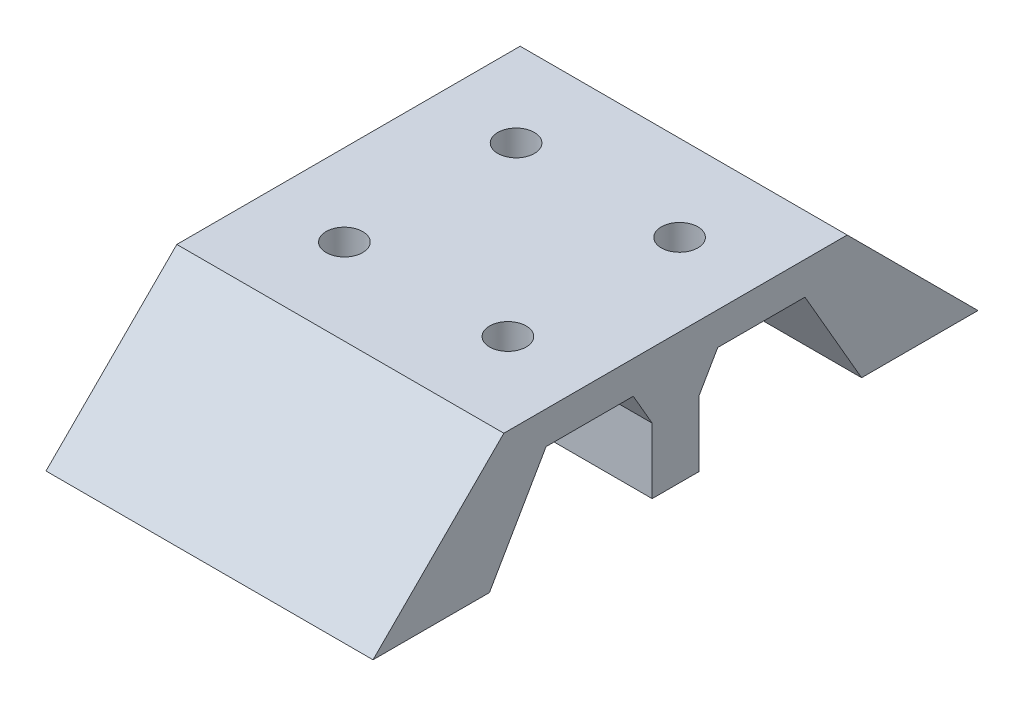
ISO-10303-21;
HEADER;
FILE_DESCRIPTION(('STEP AP214'),'2;1');
FILE_NAME('part.step','',(''),(''),'','','');
FILE_SCHEMA(('AUTOMOTIVE_DESIGN { 1 0 10303 214 1 1 1 1 }'));
ENDSEC;
DATA;
#1=APPLICATION_CONTEXT('core data for automotive mechanical design processes');
#2=APPLICATION_PROTOCOL_DEFINITION('international standard','automotive_design',2000,#1);
#3=PRODUCT_CONTEXT('',#1,'mechanical');
#4=PRODUCT('Part','Part','',(#3));
#5=PRODUCT_RELATED_PRODUCT_CATEGORY('part','',(#4));
#6=PRODUCT_DEFINITION_FORMATION('','',#4);
#7=PRODUCT_DEFINITION_CONTEXT('part definition',#1,'design');
#8=PRODUCT_DEFINITION('design','',#6,#7);
#9=PRODUCT_DEFINITION_SHAPE('','',#8);
#10=(LENGTH_UNIT() NAMED_UNIT(*) SI_UNIT(.MILLI.,.METRE.));
#11=(NAMED_UNIT(*) PLANE_ANGLE_UNIT() SI_UNIT($,.RADIAN.));
#12=(NAMED_UNIT(*) SI_UNIT($,.STERADIAN.) SOLID_ANGLE_UNIT());
#13=UNCERTAINTY_MEASURE_WITH_UNIT(LENGTH_MEASURE(1.E-05),#10,'distance_accuracy_value','');
#14=(GEOMETRIC_REPRESENTATION_CONTEXT(3) GLOBAL_UNCERTAINTY_ASSIGNED_CONTEXT((#13)) GLOBAL_UNIT_ASSIGNED_CONTEXT((#10,
#11,#12)) REPRESENTATION_CONTEXT('',''));
#15=CARTESIAN_POINT('',(0.,0.,0.));
#16=DIRECTION('',(0.,0.,1.));
#17=DIRECTION('',(1.,0.,0.));
#18=AXIS2_PLACEMENT_3D('',#15,#16,#17);
#19=CARTESIAN_POINT('',(38.1,10.9525,10.9524999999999));
#20=DIRECTION('',(0.,-0.707106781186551,-0.707106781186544));
#21=DIRECTION('',(0.,0.707106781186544,-0.707106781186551));
#22=AXIS2_PLACEMENT_3D('',#19,#20,#21);
#23=PLANE('',#22);
#24=DIRECTION('',(0.,-0.707106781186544,0.707106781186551));
#25=VECTOR('',#24,1.);
#26=CARTESIAN_POINT('',(0.,10.9525,10.9524999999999));
#27=LINE('',#26,#25);
#28=CARTESIAN_POINT('',(0.,1.905,20.));
#29=VERTEX_POINT('',#28);
#30=CARTESIAN_POINT('',(0.,-13.335,35.2400000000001));
#31=VERTEX_POINT('',#30);
#32=EDGE_CURVE('E184',#29,#31,#27,.T.);
#33=ORIENTED_EDGE('',*,*,#32,.T.);
#34=DIRECTION('',(-1.,0.,0.));
#35=VECTOR('',#34,1.);
#36=CARTESIAN_POINT('',(38.1,-13.335,35.2400000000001));
#37=LINE('',#36,#35);
#38=CARTESIAN_POINT('',(38.1,-13.335,35.2400000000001));
#39=VERTEX_POINT('',#38);
#40=EDGE_CURVE('E270',#39,#31,#37,.T.);
#41=ORIENTED_EDGE('',*,*,#40,.F.);
#42=DIRECTION('',(0.,-0.707106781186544,0.707106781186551));
#43=VECTOR('',#42,1.);
#44=CARTESIAN_POINT('',(38.1,10.9525,10.9524999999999));
#45=LINE('',#44,#43);
#46=CARTESIAN_POINT('',(38.1,1.905,20.));
#47=VERTEX_POINT('',#46);
#48=EDGE_CURVE('E236',#47,#39,#45,.T.);
#49=ORIENTED_EDGE('',*,*,#48,.F.);
#50=DIRECTION('',(-1.,0.,0.));
#51=VECTOR('',#50,1.);
#52=CARTESIAN_POINT('',(38.1,1.905,20.));
#53=LINE('',#52,#51);
#54=EDGE_CURVE('E180',#47,#29,#53,.T.);
#55=ORIENTED_EDGE('',*,*,#54,.T.);
#56=EDGE_LOOP('',(#33,#41,#49,#55));
#57=FACE_BOUND('',#56,.T.);
#58=ADVANCED_FACE('F45',(#57),#23,.F.);
#59=CARTESIAN_POINT('',(38.1,-13.335,0.));
#60=DIRECTION('',(0.,1.,0.));
#61=DIRECTION('',(0.,0.,1.));
#62=AXIS2_PLACEMENT_3D('',#59,#60,#61);
#63=PLANE('',#62);
#64=DIRECTION('',(0.,0.,-1.));
#65=VECTOR('',#64,1.);
#66=CARTESIAN_POINT('',(0.,-13.335,0.));
#67=LINE('',#66,#65);
#68=CARTESIAN_POINT('',(0.,-13.335,21.6791135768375));
#69=VERTEX_POINT('',#68);
#70=EDGE_CURVE('E188',#31,#69,#67,.T.);
#71=ORIENTED_EDGE('',*,*,#70,.T.);
#72=DIRECTION('',(-1.,0.,0.));
#73=VECTOR('',#72,1.);
#74=CARTESIAN_POINT('',(38.1,-13.335,21.6791135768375));
#75=LINE('',#74,#73);
#76=CARTESIAN_POINT('',(38.1,-13.335,21.6791135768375));
#77=VERTEX_POINT('',#76);
#78=EDGE_CURVE('E267',#77,#69,#75,.T.);
#79=ORIENTED_EDGE('',*,*,#78,.F.);
#80=DIRECTION('',(0.,0.,-1.));
#81=VECTOR('',#80,1.);
#82=CARTESIAN_POINT('',(38.1,-13.335,0.));
#83=LINE('',#82,#81);
#84=EDGE_CURVE('E122',#39,#77,#83,.T.);
#85=ORIENTED_EDGE('',*,*,#84,.F.);
#86=ORIENTED_EDGE('',*,*,#40,.T.);
#87=EDGE_LOOP('',(#71,#79,#85,#86));
#88=FACE_BOUND('',#87,.T.);
#89=ADVANCED_FACE('F400',(#88),#63,.F.);
#90=CARTESIAN_POINT('',(38.1,6.05358154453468,10.4851108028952));
#91=DIRECTION('',(0.,-0.500000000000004,-0.866025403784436));
#92=DIRECTION('',(0.,0.866025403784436,-0.500000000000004));
#93=AXIS2_PLACEMENT_3D('',#90,#91,#92);
#94=PLANE('',#93);
#95=DIRECTION('',(0.,-0.866025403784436,0.500000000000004));
#96=VECTOR('',#95,1.);
#97=CARTESIAN_POINT('',(0.,6.05358154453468,10.4851108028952));
#98=LINE('',#97,#96);
#99=CARTESIAN_POINT('',(0.,-1.905,15.08));
#100=VERTEX_POINT('',#99);
#101=EDGE_CURVE('E193',#100,#69,#98,.T.);
#102=ORIENTED_EDGE('',*,*,#101,.F.);
#103=DIRECTION('',(-1.,0.,0.));
#104=VECTOR('',#103,1.);
#105=CARTESIAN_POINT('',(38.1,-1.905,15.08));
#106=LINE('',#105,#104);
#107=CARTESIAN_POINT('',(38.1,-1.905,15.08));
#108=VERTEX_POINT('',#107);
#109=EDGE_CURVE('E264',#108,#100,#106,.T.);
#110=ORIENTED_EDGE('',*,*,#109,.F.);
#111=DIRECTION('',(0.,-0.866025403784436,0.500000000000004));
#112=VECTOR('',#111,1.);
#113=CARTESIAN_POINT('',(38.1,6.05358154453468,10.4851108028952));
#114=LINE('',#113,#112);
#115=EDGE_CURVE('E346',#108,#77,#114,.T.);
#116=ORIENTED_EDGE('',*,*,#115,.T.);
#117=ORIENTED_EDGE('',*,*,#78,.T.);
#118=EDGE_LOOP('',(#102,#110,#116,#117));
#119=FACE_BOUND('',#118,.T.);
#120=ADVANCED_FACE('F405',(#119),#94,.T.);
#121=CARTESIAN_POINT('',(38.1,-1.905,0.));
#122=DIRECTION('',(0.,1.,0.));
#123=DIRECTION('',(0.,0.,1.));
#124=AXIS2_PLACEMENT_3D('',#121,#122,#123);
#125=PLANE('',#124);
#126=CARTESIAN_POINT('',(9.525,-1.905,9.99999999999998));
#127=DIRECTION('',(0.,1.,0.));
#128=DIRECTION('',(0.,0.,1.));
#129=AXIS2_PLACEMENT_3D('',#126,#127,#128);
#130=CIRCLE('',#129,3.18770000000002);
#131=CARTESIAN_POINT('',(9.525,-1.905,13.1877));
#132=VERTEX_POINT('',#131);
#133=EDGE_CURVE('E300',#132,#132,#130,.T.);
#134=ORIENTED_EDGE('',*,*,#133,.T.);
#135=EDGE_LOOP('',(#134));
#136=FACE_BOUND('',#135,.T.);
#137=CARTESIAN_POINT('',(28.575,-1.905,9.99999999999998));
#138=DIRECTION('',(0.,1.,0.));
#139=DIRECTION('',(0.,0.,1.));
#140=AXIS2_PLACEMENT_3D('',#137,#138,#139);
#141=CIRCLE('',#140,3.18770000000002);
#142=CARTESIAN_POINT('',(28.575,-1.905,13.1877));
#143=VERTEX_POINT('',#142);
#144=EDGE_CURVE('E296',#143,#143,#141,.T.);
#145=ORIENTED_EDGE('',*,*,#144,.T.);
#146=EDGE_LOOP('',(#145));
#147=FACE_BOUND('',#146,.T.);
#148=DIRECTION('',(0.,0.,-1.));
#149=VECTOR('',#148,1.);
#150=CARTESIAN_POINT('',(0.,-1.905,0.));
#151=LINE('',#150,#149);
#152=CARTESIAN_POINT('',(0.,-1.905,4.91999999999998));
#153=VERTEX_POINT('',#152);
#154=EDGE_CURVE('E197',#100,#153,#151,.T.);
#155=ORIENTED_EDGE('',*,*,#154,.T.);
#156=DIRECTION('',(-1.,0.,0.));
#157=VECTOR('',#156,1.);
#158=CARTESIAN_POINT('',(38.1,-1.905,4.91999999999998));
#159=LINE('',#158,#157);
#160=CARTESIAN_POINT('',(38.1,-1.905,4.91999999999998));
#161=VERTEX_POINT('',#160);
#162=EDGE_CURVE('E261',#161,#153,#159,.T.);
#163=ORIENTED_EDGE('',*,*,#162,.F.);
#164=DIRECTION('',(0.,0.,-1.));
#165=VECTOR('',#164,1.);
#166=CARTESIAN_POINT('',(38.1,-1.905,0.));
#167=LINE('',#166,#165);
#168=EDGE_CURVE('E350',#108,#161,#167,.T.);
#169=ORIENTED_EDGE('',*,*,#168,.F.);
#170=ORIENTED_EDGE('',*,*,#109,.T.);
#171=EDGE_LOOP('',(#155,#163,#169,#170));
#172=FACE_BOUND('',#171,.T.);
#173=ADVANCED_FACE('F510',(#136,#147,#172),#125,.F.);
#174=CARTESIAN_POINT('',(38.1,-2.60667249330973,4.51488919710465));
#175=DIRECTION('',(0.,-0.500000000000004,0.866025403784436));
#176=DIRECTION('',(0.,-0.866025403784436,-0.500000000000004));
#177=AXIS2_PLACEMENT_3D('',#174,#175,#176);
#178=PLANE('',#177);
#179=DIRECTION('',(0.,0.866025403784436,0.500000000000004));
#180=VECTOR('',#179,1.);
#181=CARTESIAN_POINT('',(0.,-2.60667249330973,4.51488919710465));
#182=LINE('',#181,#180);
#183=CARTESIAN_POINT('',(0.,-5.715,2.72029547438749));
#184=VERTEX_POINT('',#183);
#185=EDGE_CURVE('E201',#184,#153,#182,.T.);
#186=ORIENTED_EDGE('',*,*,#185,.F.);
#187=DIRECTION('',(-1.,0.,0.));
#188=VECTOR('',#187,1.);
#189=CARTESIAN_POINT('',(38.1,-5.715,2.72029547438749));
#190=LINE('',#189,#188);
#191=CARTESIAN_POINT('',(38.1,-5.715,2.72029547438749));
#192=VERTEX_POINT('',#191);
#193=EDGE_CURVE('E258',#192,#184,#190,.T.);
#194=ORIENTED_EDGE('',*,*,#193,.F.);
#195=DIRECTION('',(0.,0.866025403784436,0.500000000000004));
#196=VECTOR('',#195,1.);
#197=CARTESIAN_POINT('',(38.1,-2.60667249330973,4.51488919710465));
#198=LINE('',#197,#196);
#199=EDGE_CURVE('E353',#192,#161,#198,.T.);
#200=ORIENTED_EDGE('',*,*,#199,.T.);
#201=ORIENTED_EDGE('',*,*,#162,.T.);
#202=EDGE_LOOP('',(#186,#194,#200,#201));
#203=FACE_BOUND('',#202,.T.);
#204=ADVANCED_FACE('F514',(#203),#178,.T.);
#205=CARTESIAN_POINT('',(38.1,0.,2.72029547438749));
#206=DIRECTION('',(0.,0.,1.));
#207=DIRECTION('',(1.,0.,0.));
#208=AXIS2_PLACEMENT_3D('',#205,#206,#207);
#209=PLANE('',#208);
#210=DIRECTION('',(0.,1.,0.));
#211=VECTOR('',#210,1.);
#212=CARTESIAN_POINT('',(0.,0.,2.72029547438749));
#213=LINE('',#212,#211);
#214=CARTESIAN_POINT('',(0.,-13.335,2.72029547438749));
#215=VERTEX_POINT('',#214);
#216=EDGE_CURVE('E205',#215,#184,#213,.T.);
#217=ORIENTED_EDGE('',*,*,#216,.F.);
#218=DIRECTION('',(-1.,0.,0.));
#219=VECTOR('',#218,1.);
#220=CARTESIAN_POINT('',(38.1,-13.335,2.72029547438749));
#221=LINE('',#220,#219);
#222=CARTESIAN_POINT('',(38.1,-13.335,2.72029547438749));
#223=VERTEX_POINT('',#222);
#224=EDGE_CURVE('E255',#223,#215,#221,.T.);
#225=ORIENTED_EDGE('',*,*,#224,.F.);
#226=DIRECTION('',(0.,1.,0.));
#227=VECTOR('',#226,1.);
#228=CARTESIAN_POINT('',(38.1,0.,2.72029547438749));
#229=LINE('',#228,#227);
#230=EDGE_CURVE('E357',#223,#192,#229,.T.);
#231=ORIENTED_EDGE('',*,*,#230,.T.);
#232=ORIENTED_EDGE('',*,*,#193,.T.);
#233=EDGE_LOOP('',(#217,#225,#231,#232));
#234=FACE_BOUND('',#233,.T.);
#235=ADVANCED_FACE('F599',(#234),#209,.T.);
#236=CARTESIAN_POINT('',(38.1,-13.335,0.));
#237=DIRECTION('',(0.,-1.,0.));
#238=DIRECTION('',(0.,0.,-1.));
#239=AXIS2_PLACEMENT_3D('',#236,#237,#238);
#240=PLANE('',#239);
#241=DIRECTION('',(0.,0.,1.));
#242=VECTOR('',#241,1.);
#243=CARTESIAN_POINT('',(0.,-13.335,0.));
#244=LINE('',#243,#242);
#245=CARTESIAN_POINT('',(0.,-13.335,-2.72029547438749));
#246=VERTEX_POINT('',#245);
#247=EDGE_CURVE('E209',#246,#215,#244,.T.);
#248=ORIENTED_EDGE('',*,*,#247,.F.);
#249=DIRECTION('',(-1.,0.,0.));
#250=VECTOR('',#249,1.);
#251=CARTESIAN_POINT('',(38.1,-13.335,-2.72029547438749));
#252=LINE('',#251,#250);
#253=CARTESIAN_POINT('',(38.1,-13.335,-2.72029547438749));
#254=VERTEX_POINT('',#253);
#255=EDGE_CURVE('E252',#254,#246,#252,.T.);
#256=ORIENTED_EDGE('',*,*,#255,.F.);
#257=DIRECTION('',(0.,0.,1.));
#258=VECTOR('',#257,1.);
#259=CARTESIAN_POINT('',(38.1,-13.335,0.));
#260=LINE('',#259,#258);
#261=EDGE_CURVE('E361',#254,#223,#260,.T.);
#262=ORIENTED_EDGE('',*,*,#261,.T.);
#263=ORIENTED_EDGE('',*,*,#224,.T.);
#264=EDGE_LOOP('',(#248,#256,#262,#263));
#265=FACE_BOUND('',#264,.T.);
#266=ADVANCED_FACE('F595',(#265),#240,.T.);
#267=CARTESIAN_POINT('',(38.1,0.,-2.72029547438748));
#268=DIRECTION('',(0.,0.,-1.));
#269=DIRECTION('',(0.,1.,0.));
#270=AXIS2_PLACEMENT_3D('',#267,#268,#269);
#271=PLANE('',#270);
#272=DIRECTION('',(0.,-1.,0.));
#273=VECTOR('',#272,1.);
#274=CARTESIAN_POINT('',(0.,0.,-2.72029547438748));
#275=LINE('',#274,#273);
#276=CARTESIAN_POINT('',(0.,-5.715,-2.72029547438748));
#277=VERTEX_POINT('',#276);
#278=EDGE_CURVE('E213',#277,#246,#275,.T.);
#279=ORIENTED_EDGE('',*,*,#278,.F.);
#280=DIRECTION('',(-1.,0.,0.));
#281=VECTOR('',#280,1.);
#282=CARTESIAN_POINT('',(38.1,-5.715,-2.72029547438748));
#283=LINE('',#282,#281);
#284=CARTESIAN_POINT('',(38.1,-5.715,-2.72029547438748));
#285=VERTEX_POINT('',#284);
#286=EDGE_CURVE('E249',#285,#277,#283,.T.);
#287=ORIENTED_EDGE('',*,*,#286,.F.);
#288=DIRECTION('',(0.,-1.,0.));
#289=VECTOR('',#288,1.);
#290=CARTESIAN_POINT('',(38.1,0.,-2.72029547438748));
#291=LINE('',#290,#289);
#292=EDGE_CURVE('E365',#285,#254,#291,.T.);
#293=ORIENTED_EDGE('',*,*,#292,.T.);
#294=ORIENTED_EDGE('',*,*,#255,.T.);
#295=EDGE_LOOP('',(#279,#287,#293,#294));
#296=FACE_BOUND('',#295,.T.);
#297=ADVANCED_FACE('F592',(#296),#271,.T.);
#298=CARTESIAN_POINT('',(38.1,-2.60667249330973,-4.51488919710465));
#299=DIRECTION('',(0.,-0.500000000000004,-0.866025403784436));
#300=DIRECTION('',(0.,0.866025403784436,-0.500000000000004));
#301=AXIS2_PLACEMENT_3D('',#298,#299,#300);
#302=PLANE('',#301);
#303=DIRECTION('',(0.,-0.866025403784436,0.500000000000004));
#304=VECTOR('',#303,1.);
#305=CARTESIAN_POINT('',(0.,-2.60667249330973,-4.51488919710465));
#306=LINE('',#305,#304);
#307=CARTESIAN_POINT('',(0.,-1.905,-4.91999999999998));
#308=VERTEX_POINT('',#307);
#309=EDGE_CURVE('E217',#308,#277,#306,.T.);
#310=ORIENTED_EDGE('',*,*,#309,.F.);
#311=DIRECTION('',(-1.,0.,0.));
#312=VECTOR('',#311,1.);
#313=CARTESIAN_POINT('',(38.1,-1.905,-4.91999999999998));
#314=LINE('',#313,#312);
#315=CARTESIAN_POINT('',(38.1,-1.905,-4.91999999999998));
#316=VERTEX_POINT('',#315);
#317=EDGE_CURVE('E246',#316,#308,#314,.T.);
#318=ORIENTED_EDGE('',*,*,#317,.F.);
#319=DIRECTION('',(0.,-0.866025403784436,0.500000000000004));
#320=VECTOR('',#319,1.);
#321=CARTESIAN_POINT('',(38.1,-2.60667249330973,-4.51488919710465));
#322=LINE('',#321,#320);
#323=EDGE_CURVE('E369',#316,#285,#322,.T.);
#324=ORIENTED_EDGE('',*,*,#323,.T.);
#325=ORIENTED_EDGE('',*,*,#286,.T.);
#326=EDGE_LOOP('',(#310,#318,#324,#325));
#327=FACE_BOUND('',#326,.T.);
#328=ADVANCED_FACE('F527',(#327),#302,.T.);
#329=CARTESIAN_POINT('',(38.1,-1.905,0.));
#330=DIRECTION('',(0.,-1.,0.));
#331=DIRECTION('',(0.,0.,-1.));
#332=AXIS2_PLACEMENT_3D('',#329,#330,#331);
#333=PLANE('',#332);
#334=CARTESIAN_POINT('',(28.575,-1.905,-9.99999999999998));
#335=DIRECTION('',(0.,-1.,0.));
#336=DIRECTION('',(0.,0.,-1.));
#337=AXIS2_PLACEMENT_3D('',#334,#335,#336);
#338=CIRCLE('',#337,3.18770000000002);
#339=CARTESIAN_POINT('',(28.575,-1.905,-13.1877));
#340=VERTEX_POINT('',#339);
#341=EDGE_CURVE('E56',#340,#340,#338,.F.);
#342=ORIENTED_EDGE('',*,*,#341,.T.);
#343=EDGE_LOOP('',(#342));
#344=FACE_BOUND('',#343,.T.);
#345=CARTESIAN_POINT('',(9.525,-1.905,-9.99999999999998));
#346=DIRECTION('',(0.,-1.,0.));
#347=DIRECTION('',(0.,0.,-1.));
#348=AXIS2_PLACEMENT_3D('',#345,#346,#347);
#349=CIRCLE('',#348,3.18770000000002);
#350=CARTESIAN_POINT('',(9.525,-1.905,-13.1877));
#351=VERTEX_POINT('',#350);
#352=EDGE_CURVE('E312',#351,#351,#349,.F.);
#353=ORIENTED_EDGE('',*,*,#352,.T.);
#354=EDGE_LOOP('',(#353));
#355=FACE_BOUND('',#354,.T.);
#356=DIRECTION('',(0.,0.,1.));
#357=VECTOR('',#356,1.);
#358=CARTESIAN_POINT('',(0.,-1.905,0.));
#359=LINE('',#358,#357);
#360=CARTESIAN_POINT('',(0.,-1.905,-15.08));
#361=VERTEX_POINT('',#360);
#362=EDGE_CURVE('E221',#361,#308,#359,.T.);
#363=ORIENTED_EDGE('',*,*,#362,.F.);
#364=DIRECTION('',(-1.,0.,0.));
#365=VECTOR('',#364,1.);
#366=CARTESIAN_POINT('',(38.1,-1.905,-15.08));
#367=LINE('',#366,#365);
#368=CARTESIAN_POINT('',(38.1,-1.905,-15.08));
#369=VERTEX_POINT('',#368);
#370=EDGE_CURVE('E243',#369,#361,#367,.T.);
#371=ORIENTED_EDGE('',*,*,#370,.F.);
#372=DIRECTION('',(0.,0.,1.));
#373=VECTOR('',#372,1.);
#374=CARTESIAN_POINT('',(38.1,-1.905,0.));
#375=LINE('',#374,#373);
#376=EDGE_CURVE('E373',#369,#316,#375,.T.);
#377=ORIENTED_EDGE('',*,*,#376,.T.);
#378=ORIENTED_EDGE('',*,*,#317,.T.);
#379=EDGE_LOOP('',(#363,#371,#377,#378));
#380=FACE_BOUND('',#379,.T.);
#381=ADVANCED_FACE('F319',(#344,#355,#380),#333,.T.);
#382=CARTESIAN_POINT('',(38.1,6.05358154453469,-10.4851108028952));
#383=DIRECTION('',(0.,-0.500000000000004,0.866025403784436));
#384=DIRECTION('',(0.,-0.866025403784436,-0.500000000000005));
#385=AXIS2_PLACEMENT_3D('',#382,#383,#384);
#386=PLANE('',#385);
#387=DIRECTION('',(0.,0.866025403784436,0.500000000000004));
#388=VECTOR('',#387,1.);
#389=CARTESIAN_POINT('',(0.,6.05358154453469,-10.4851108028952));
#390=LINE('',#389,#388);
#391=CARTESIAN_POINT('',(0.,-13.335,-21.6791135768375));
#392=VERTEX_POINT('',#391);
#393=EDGE_CURVE('E225',#392,#361,#390,.T.);
#394=ORIENTED_EDGE('',*,*,#393,.F.);
#395=DIRECTION('',(-1.,0.,0.));
#396=VECTOR('',#395,1.);
#397=CARTESIAN_POINT('',(38.1,-13.335,-21.6791135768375));
#398=LINE('',#397,#396);
#399=CARTESIAN_POINT('',(38.1,-13.335,-21.6791135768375));
#400=VERTEX_POINT('',#399);
#401=EDGE_CURVE('E174',#400,#392,#398,.T.);
#402=ORIENTED_EDGE('',*,*,#401,.F.);
#403=DIRECTION('',(0.,0.866025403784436,0.500000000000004));
#404=VECTOR('',#403,1.);
#405=CARTESIAN_POINT('',(38.1,6.05358154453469,-10.4851108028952));
#406=LINE('',#405,#404);
#407=EDGE_CURVE('E161',#400,#369,#406,.T.);
#408=ORIENTED_EDGE('',*,*,#407,.T.);
#409=ORIENTED_EDGE('',*,*,#370,.T.);
#410=EDGE_LOOP('',(#394,#402,#408,#409));
#411=FACE_BOUND('',#410,.T.);
#412=ADVANCED_FACE('F379',(#411),#386,.T.);
#413=CARTESIAN_POINT('',(38.1,-13.335,0.));
#414=DIRECTION('',(0.,1.,0.));
#415=DIRECTION('',(0.,0.,1.));
#416=AXIS2_PLACEMENT_3D('',#413,#414,#415);
#417=PLANE('',#416);
#418=DIRECTION('',(0.,0.,-1.));
#419=VECTOR('',#418,1.);
#420=CARTESIAN_POINT('',(0.,-13.335,0.));
#421=LINE('',#420,#419);
#422=CARTESIAN_POINT('',(0.,-13.335,-35.2399999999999));
#423=VERTEX_POINT('',#422);
#424=EDGE_CURVE('E169',#392,#423,#421,.T.);
#425=ORIENTED_EDGE('',*,*,#424,.T.);
#426=DIRECTION('',(-1.,0.,0.));
#427=VECTOR('',#426,1.);
#428=CARTESIAN_POINT('',(38.1,-13.335,-35.2399999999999));
#429=LINE('',#428,#427);
#430=CARTESIAN_POINT('',(38.1,-13.335,-35.2399999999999));
#431=VERTEX_POINT('',#430);
#432=EDGE_CURVE('E166',#431,#423,#429,.T.);
#433=ORIENTED_EDGE('',*,*,#432,.F.);
#434=DIRECTION('',(0.,0.,-1.));
#435=VECTOR('',#434,1.);
#436=CARTESIAN_POINT('',(38.1,-13.335,0.));
#437=LINE('',#436,#435);
#438=EDGE_CURVE('E154',#400,#431,#437,.T.);
#439=ORIENTED_EDGE('',*,*,#438,.F.);
#440=ORIENTED_EDGE('',*,*,#401,.T.);
#441=EDGE_LOOP('',(#425,#433,#439,#440));
#442=FACE_BOUND('',#441,.T.);
#443=ADVANCED_FACE('F167',(#442),#417,.F.);
#444=CARTESIAN_POINT('',(38.1,10.9525,-10.9525000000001));
#445=DIRECTION('',(0.,0.707106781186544,-0.707106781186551));
#446=DIRECTION('',(0.,0.707106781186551,0.707106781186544));
#447=AXIS2_PLACEMENT_3D('',#444,#445,#446);
#448=PLANE('',#447);
#449=DIRECTION('',(0.,-0.707106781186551,-0.707106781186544));
#450=VECTOR('',#449,1.);
#451=CARTESIAN_POINT('',(0.,10.9525,-10.9525000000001));
#452=LINE('',#451,#450);
#453=CARTESIAN_POINT('',(0.,1.905,-20.));
#454=VERTEX_POINT('',#453);
#455=EDGE_CURVE('E231',#454,#423,#452,.T.);
#456=ORIENTED_EDGE('',*,*,#455,.F.);
#457=DIRECTION('',(-1.,0.,0.));
#458=VECTOR('',#457,1.);
#459=CARTESIAN_POINT('',(38.1,1.905,-20.));
#460=LINE('',#459,#458);
#461=CARTESIAN_POINT('',(38.1,1.905,-20.));
#462=VERTEX_POINT('',#461);
#463=EDGE_CURVE('E110',#462,#454,#460,.T.);
#464=ORIENTED_EDGE('',*,*,#463,.F.);
#465=DIRECTION('',(0.,-0.707106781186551,-0.707106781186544));
#466=VECTOR('',#465,1.);
#467=CARTESIAN_POINT('',(38.1,10.9525,-10.9525000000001));
#468=LINE('',#467,#466);
#469=EDGE_CURVE('E158',#462,#431,#468,.T.);
#470=ORIENTED_EDGE('',*,*,#469,.T.);
#471=ORIENTED_EDGE('',*,*,#432,.T.);
#472=EDGE_LOOP('',(#456,#464,#470,#471));
#473=FACE_BOUND('',#472,.T.);
#474=ADVANCED_FACE('F176',(#473),#448,.T.);
#475=CARTESIAN_POINT('',(38.1,1.905,0.));
#476=DIRECTION('',(0.,-1.,0.));
#477=DIRECTION('',(0.,0.,-1.));
#478=AXIS2_PLACEMENT_3D('',#475,#476,#477);
#479=PLANE('',#478);
#480=CARTESIAN_POINT('',(9.525,1.905,-9.99999999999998));
#481=DIRECTION('',(0.,-1.,0.));
#482=DIRECTION('',(0.,0.,-1.));
#483=AXIS2_PLACEMENT_3D('',#480,#481,#482);
#484=CIRCLE('',#483,2.12997301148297);
#485=CARTESIAN_POINT('',(9.525,1.905,-12.129973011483));
#486=VERTEX_POINT('',#485);
#487=EDGE_CURVE('E288',#486,#486,#484,.T.);
#488=ORIENTED_EDGE('',*,*,#487,.T.);
#489=EDGE_LOOP('',(#488));
#490=FACE_BOUND('',#489,.T.);
#491=CARTESIAN_POINT('',(9.525,1.905,9.99999999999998));
#492=DIRECTION('',(0.,-1.,0.));
#493=DIRECTION('',(0.,0.,-1.));
#494=AXIS2_PLACEMENT_3D('',#491,#492,#493);
#495=CIRCLE('',#494,2.12997301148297);
#496=CARTESIAN_POINT('',(9.525,1.905,7.87002698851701));
#497=VERTEX_POINT('',#496);
#498=EDGE_CURVE('E283',#497,#497,#495,.T.);
#499=ORIENTED_EDGE('',*,*,#498,.T.);
#500=EDGE_LOOP('',(#499));
#501=FACE_BOUND('',#500,.T.);
#502=CARTESIAN_POINT('',(28.575,1.905,9.99999999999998));
#503=DIRECTION('',(0.,-1.,0.));
#504=DIRECTION('',(0.,0.,-1.));
#505=AXIS2_PLACEMENT_3D('',#502,#503,#504);
#506=CIRCLE('',#505,2.12997301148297);
#507=CARTESIAN_POINT('',(28.575,1.905,7.87002698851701));
#508=VERTEX_POINT('',#507);
#509=EDGE_CURVE('E278',#508,#508,#506,.T.);
#510=ORIENTED_EDGE('',*,*,#509,.T.);
#511=EDGE_LOOP('',(#510));
#512=FACE_BOUND('',#511,.T.);
#513=CARTESIAN_POINT('',(28.575,1.905,-9.99999999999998));
#514=DIRECTION('',(0.,-1.,0.));
#515=DIRECTION('',(0.,0.,-1.));
#516=AXIS2_PLACEMENT_3D('',#513,#514,#515);
#517=CIRCLE('',#516,2.12997301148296);
#518=CARTESIAN_POINT('',(28.575,1.905,-12.1299730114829));
#519=VERTEX_POINT('',#518);
#520=EDGE_CURVE('E189',#519,#519,#517,.T.);
#521=ORIENTED_EDGE('',*,*,#520,.T.);
#522=EDGE_LOOP('',(#521));
#523=FACE_BOUND('',#522,.T.);
#524=DIRECTION('',(0.,0.,1.));
#525=VECTOR('',#524,1.);
#526=CARTESIAN_POINT('',(0.,1.905,0.));
#527=LINE('',#526,#525);
#528=EDGE_CURVE('E113',#454,#29,#527,.T.);
#529=ORIENTED_EDGE('',*,*,#528,.T.);
#530=ORIENTED_EDGE('',*,*,#54,.F.);
#531=DIRECTION('',(0.,0.,1.));
#532=VECTOR('',#531,1.);
#533=CARTESIAN_POINT('',(38.1,1.905,0.));
#534=LINE('',#533,#532);
#535=EDGE_CURVE('E64',#462,#47,#534,.T.);
#536=ORIENTED_EDGE('',*,*,#535,.F.);
#537=ORIENTED_EDGE('',*,*,#463,.T.);
#538=EDGE_LOOP('',(#529,#530,#536,#537));
#539=FACE_BOUND('',#538,.T.);
#540=ADVANCED_FACE('F387',(#490,#501,#512,#523,#539),#479,.F.);
#541=CARTESIAN_POINT('',(38.1,0.,0.));
#542=DIRECTION('',(1.,0.,0.));
#543=DIRECTION('',(0.,0.,-1.));
#544=AXIS2_PLACEMENT_3D('',#541,#542,#543);
#545=PLANE('',#544);
#546=ORIENTED_EDGE('',*,*,#48,.T.);
#547=ORIENTED_EDGE('',*,*,#84,.T.);
#548=ORIENTED_EDGE('',*,*,#115,.F.);
#549=ORIENTED_EDGE('',*,*,#168,.T.);
#550=ORIENTED_EDGE('',*,*,#199,.F.);
#551=ORIENTED_EDGE('',*,*,#230,.F.);
#552=ORIENTED_EDGE('',*,*,#261,.F.);
#553=ORIENTED_EDGE('',*,*,#292,.F.);
#554=ORIENTED_EDGE('',*,*,#323,.F.);
#555=ORIENTED_EDGE('',*,*,#376,.F.);
#556=ORIENTED_EDGE('',*,*,#407,.F.);
#557=ORIENTED_EDGE('',*,*,#438,.T.);
#558=ORIENTED_EDGE('',*,*,#469,.F.);
#559=ORIENTED_EDGE('',*,*,#535,.T.);
#560=EDGE_LOOP('',(#546,#547,#548,#549,#550,#551,#552,#553,#554,#555,#556,#557,#558,#559));
#561=FACE_BOUND('',#560,.T.);
#562=ADVANCED_FACE('F156',(#561),#545,.T.);
#563=CARTESIAN_POINT('',(0.,0.,0.));
#564=DIRECTION('',(1.,0.,0.));
#565=DIRECTION('',(0.,0.,-1.));
#566=AXIS2_PLACEMENT_3D('',#563,#564,#565);
#567=PLANE('',#566);
#568=ORIENTED_EDGE('',*,*,#32,.F.);
#569=ORIENTED_EDGE('',*,*,#528,.F.);
#570=ORIENTED_EDGE('',*,*,#455,.T.);
#571=ORIENTED_EDGE('',*,*,#424,.F.);
#572=ORIENTED_EDGE('',*,*,#393,.T.);
#573=ORIENTED_EDGE('',*,*,#362,.T.);
#574=ORIENTED_EDGE('',*,*,#309,.T.);
#575=ORIENTED_EDGE('',*,*,#278,.T.);
#576=ORIENTED_EDGE('',*,*,#247,.T.);
#577=ORIENTED_EDGE('',*,*,#216,.T.);
#578=ORIENTED_EDGE('',*,*,#185,.T.);
#579=ORIENTED_EDGE('',*,*,#154,.F.);
#580=ORIENTED_EDGE('',*,*,#101,.T.);
#581=ORIENTED_EDGE('',*,*,#70,.F.);
#582=EDGE_LOOP('',(#568,#569,#570,#571,#572,#573,#574,#575,#576,#577,#578,#579,#580,#581));
#583=FACE_BOUND('',#582,.T.);
#584=ADVANCED_FACE('F383',(#583),#567,.F.);
#585=CARTESIAN_POINT('',(28.575,1.651,-9.99999999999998));
#586=DIRECTION('',(0.,-1.,0.));
#587=DIRECTION('',(0.,0.,-1.));
#588=AXIS2_PLACEMENT_3D('',#585,#586,#587);
#589=CONICAL_SURFACE('',#588,2.5527,1.02974425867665);
#590=CARTESIAN_POINT('',(28.575,1.651,-9.99999999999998));
#591=DIRECTION('',(0.,-1.,0.));
#592=DIRECTION('',(0.,0.,-1.));
#593=AXIS2_PLACEMENT_3D('',#590,#591,#592);
#594=CIRCLE('',#593,2.5527);
#595=CARTESIAN_POINT('',(28.575,1.651,-12.5527));
#596=VERTEX_POINT('',#595);
#597=EDGE_CURVE('E277',#596,#596,#594,.T.);
#598=ORIENTED_EDGE('',*,*,#597,.T.);
#599=EDGE_LOOP('',(#598));
#600=FACE_BOUND('',#599,.T.);
#601=ORIENTED_EDGE('',*,*,#520,.F.);
#602=EDGE_LOOP('',(#601));
#603=FACE_BOUND('',#602,.T.);
#604=ADVANCED_FACE('F332',(#600,#603),#589,.F.);
#605=CARTESIAN_POINT('',(28.575,-1.905,-9.99999999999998));
#606=DIRECTION('',(0.,-1.,0.));
#607=DIRECTION('',(0.,0.,-1.));
#608=AXIS2_PLACEMENT_3D('',#605,#606,#607);
#609=CYLINDRICAL_SURFACE('',#608,2.5527);
#610=CARTESIAN_POINT('',(28.575,-1.53838257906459,-9.99999999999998));
#611=DIRECTION('',(0.,-1.,0.));
#612=DIRECTION('',(0.,0.,-1.));
#613=AXIS2_PLACEMENT_3D('',#610,#611,#612);
#614=CIRCLE('',#613,2.5527);
#615=CARTESIAN_POINT('',(28.575,-1.53838257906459,-12.5527));
#616=VERTEX_POINT('',#615);
#617=EDGE_CURVE('E308',#616,#616,#614,.T.);
#618=ORIENTED_EDGE('',*,*,#617,.T.);
#619=EDGE_LOOP('',(#618));
#620=FACE_BOUND('',#619,.T.);
#621=ORIENTED_EDGE('',*,*,#597,.F.);
#622=EDGE_LOOP('',(#621));
#623=FACE_BOUND('',#622,.T.);
#624=ADVANCED_FACE('F328',(#620,#623),#609,.F.);
#625=CARTESIAN_POINT('',(28.575,1.651,9.99999999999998));
#626=DIRECTION('',(0.,-1.,0.));
#627=DIRECTION('',(0.,0.,-1.));
#628=AXIS2_PLACEMENT_3D('',#625,#626,#627);
#629=CONICAL_SURFACE('',#628,2.5527,1.02974425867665);
#630=CARTESIAN_POINT('',(28.575,1.651,9.99999999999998));
#631=DIRECTION('',(0.,-1.,0.));
#632=DIRECTION('',(0.,0.,-1.));
#633=AXIS2_PLACEMENT_3D('',#630,#631,#632);
#634=CIRCLE('',#633,2.5527);
#635=CARTESIAN_POINT('',(28.575,1.651,7.44729999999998));
#636=VERTEX_POINT('',#635);
#637=EDGE_CURVE('E282',#636,#636,#634,.T.);
#638=ORIENTED_EDGE('',*,*,#637,.T.);
#639=EDGE_LOOP('',(#638));
#640=FACE_BOUND('',#639,.T.);
#641=ORIENTED_EDGE('',*,*,#509,.F.);
#642=EDGE_LOOP('',(#641));
#643=FACE_BOUND('',#642,.T.);
#644=ADVANCED_FACE('F331',(#640,#643),#629,.F.);
#645=CARTESIAN_POINT('',(28.575,-1.905,9.99999999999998));
#646=DIRECTION('',(0.,-1.,0.));
#647=DIRECTION('',(0.,0.,-1.));
#648=AXIS2_PLACEMENT_3D('',#645,#646,#647);
#649=CYLINDRICAL_SURFACE('',#648,2.5527);
#650=CARTESIAN_POINT('',(28.575,-1.53838257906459,9.99999999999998));
#651=DIRECTION('',(0.,1.,0.));
#652=DIRECTION('',(0.,0.,1.));
#653=AXIS2_PLACEMENT_3D('',#650,#651,#652);
#654=CIRCLE('',#653,2.5527);
#655=CARTESIAN_POINT('',(28.575,-1.53838257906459,12.5527));
#656=VERTEX_POINT('',#655);
#657=EDGE_CURVE('E304',#656,#656,#654,.F.);
#658=ORIENTED_EDGE('',*,*,#657,.T.);
#659=EDGE_LOOP('',(#658));
#660=FACE_BOUND('',#659,.T.);
#661=ORIENTED_EDGE('',*,*,#637,.F.);
#662=EDGE_LOOP('',(#661));
#663=FACE_BOUND('',#662,.T.);
#664=ADVANCED_FACE('F433',(#660,#663),#649,.F.);
#665=CARTESIAN_POINT('',(9.525,1.651,9.99999999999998));
#666=DIRECTION('',(0.,-1.,0.));
#667=DIRECTION('',(0.,0.,-1.));
#668=AXIS2_PLACEMENT_3D('',#665,#666,#667);
#669=CONICAL_SURFACE('',#668,2.5527,1.02974425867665);
#670=CARTESIAN_POINT('',(9.525,1.651,9.99999999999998));
#671=DIRECTION('',(0.,-1.,0.));
#672=DIRECTION('',(0.,0.,-1.));
#673=AXIS2_PLACEMENT_3D('',#670,#671,#672);
#674=CIRCLE('',#673,2.5527);
#675=CARTESIAN_POINT('',(9.525,1.651,7.44729999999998));
#676=VERTEX_POINT('',#675);
#677=EDGE_CURVE('E287',#676,#676,#674,.T.);
#678=ORIENTED_EDGE('',*,*,#677,.T.);
#679=EDGE_LOOP('',(#678));
#680=FACE_BOUND('',#679,.T.);
#681=ORIENTED_EDGE('',*,*,#498,.F.);
#682=EDGE_LOOP('',(#681));
#683=FACE_BOUND('',#682,.T.);
#684=ADVANCED_FACE('F436',(#680,#683),#669,.F.);
#685=CARTESIAN_POINT('',(9.525,-1.905,9.99999999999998));
#686=DIRECTION('',(0.,-1.,0.));
#687=DIRECTION('',(0.,0.,-1.));
#688=AXIS2_PLACEMENT_3D('',#685,#686,#687);
#689=CYLINDRICAL_SURFACE('',#688,2.5527);
#690=CARTESIAN_POINT('',(9.525,-1.53838257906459,9.99999999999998));
#691=DIRECTION('',(0.,1.,0.));
#692=DIRECTION('',(0.,0.,1.));
#693=AXIS2_PLACEMENT_3D('',#690,#691,#692);
#694=CIRCLE('',#693,2.5527);
#695=CARTESIAN_POINT('',(9.525,-1.53838257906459,12.5527));
#696=VERTEX_POINT('',#695);
#697=EDGE_CURVE('E273',#696,#696,#694,.F.);
#698=ORIENTED_EDGE('',*,*,#697,.T.);
#699=EDGE_LOOP('',(#698));
#700=FACE_BOUND('',#699,.T.);
#701=ORIENTED_EDGE('',*,*,#677,.F.);
#702=EDGE_LOOP('',(#701));
#703=FACE_BOUND('',#702,.T.);
#704=ADVANCED_FACE('F458',(#700,#703),#689,.F.);
#705=CARTESIAN_POINT('',(9.525,1.651,-9.99999999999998));
#706=DIRECTION('',(0.,-1.,0.));
#707=DIRECTION('',(0.,0.,-1.));
#708=AXIS2_PLACEMENT_3D('',#705,#706,#707);
#709=CONICAL_SURFACE('',#708,2.5527,1.02974425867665);
#710=CARTESIAN_POINT('',(9.525,1.651,-9.99999999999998));
#711=DIRECTION('',(0.,-1.,0.));
#712=DIRECTION('',(0.,0.,-1.));
#713=AXIS2_PLACEMENT_3D('',#710,#711,#712);
#714=CIRCLE('',#713,2.5527);
#715=CARTESIAN_POINT('',(9.525,1.651,-12.5527));
#716=VERTEX_POINT('',#715);
#717=EDGE_CURVE('E292',#716,#716,#714,.T.);
#718=ORIENTED_EDGE('',*,*,#717,.T.);
#719=EDGE_LOOP('',(#718));
#720=FACE_BOUND('',#719,.T.);
#721=ORIENTED_EDGE('',*,*,#487,.F.);
#722=EDGE_LOOP('',(#721));
#723=FACE_BOUND('',#722,.T.);
#724=ADVANCED_FACE('F449',(#720,#723),#709,.F.);
#725=CARTESIAN_POINT('',(9.525,-1.905,-9.99999999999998));
#726=DIRECTION('',(0.,-1.,0.));
#727=DIRECTION('',(0.,0.,-1.));
#728=AXIS2_PLACEMENT_3D('',#725,#726,#727);
#729=CYLINDRICAL_SURFACE('',#728,2.5527);
#730=CARTESIAN_POINT('',(9.525,-1.53838257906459,-9.99999999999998));
#731=DIRECTION('',(0.,-1.,0.));
#732=DIRECTION('',(0.,0.,-1.));
#733=AXIS2_PLACEMENT_3D('',#730,#731,#732);
#734=CIRCLE('',#733,2.5527);
#735=CARTESIAN_POINT('',(9.525,-1.53838257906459,-12.5527));
#736=VERTEX_POINT('',#735);
#737=EDGE_CURVE('E11',#736,#736,#734,.T.);
#738=ORIENTED_EDGE('',*,*,#737,.T.);
#739=EDGE_LOOP('',(#738));
#740=FACE_BOUND('',#739,.T.);
#741=ORIENTED_EDGE('',*,*,#717,.F.);
#742=EDGE_LOOP('',(#741));
#743=FACE_BOUND('',#742,.T.);
#744=ADVANCED_FACE('F416',(#740,#743),#729,.F.);
#745=CARTESIAN_POINT('',(9.525,-1.53838257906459,9.99999999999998));
#746=DIRECTION('',(0.,-1.,0.));
#747=DIRECTION('',(0.,0.,-1.));
#748=AXIS2_PLACEMENT_3D('',#745,#746,#747);
#749=CONICAL_SURFACE('',#748,2.5527,1.04719755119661);
#750=ORIENTED_EDGE('',*,*,#133,.F.);
#751=EDGE_LOOP('',(#750));
#752=FACE_BOUND('',#751,.T.);
#753=ORIENTED_EDGE('',*,*,#697,.F.);
#754=EDGE_LOOP('',(#753));
#755=FACE_BOUND('',#754,.T.);
#756=ADVANCED_FACE('F410',(#752,#755),#749,.F.);
#757=CARTESIAN_POINT('',(28.575,-1.53838257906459,9.99999999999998));
#758=DIRECTION('',(0.,-1.,0.));
#759=DIRECTION('',(0.,0.,-1.));
#760=AXIS2_PLACEMENT_3D('',#757,#758,#759);
#761=CONICAL_SURFACE('',#760,2.5527,1.04719755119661);
#762=ORIENTED_EDGE('',*,*,#144,.F.);
#763=EDGE_LOOP('',(#762));
#764=FACE_BOUND('',#763,.T.);
#765=ORIENTED_EDGE('',*,*,#657,.F.);
#766=EDGE_LOOP('',(#765));
#767=FACE_BOUND('',#766,.T.);
#768=ADVANCED_FACE('F325',(#764,#767),#761,.F.);
#769=CARTESIAN_POINT('',(28.575,-1.53838257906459,-9.99999999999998));
#770=DIRECTION('',(0.,-1.,0.));
#771=DIRECTION('',(0.,0.,-1.));
#772=AXIS2_PLACEMENT_3D('',#769,#770,#771);
#773=CONICAL_SURFACE('',#772,2.5527,1.04719755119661);
#774=ORIENTED_EDGE('',*,*,#341,.F.);
#775=EDGE_LOOP('',(#774));
#776=FACE_BOUND('',#775,.T.);
#777=ORIENTED_EDGE('',*,*,#617,.F.);
#778=EDGE_LOOP('',(#777));
#779=FACE_BOUND('',#778,.T.);
#780=ADVANCED_FACE('F322',(#776,#779),#773,.F.);
#781=CARTESIAN_POINT('',(9.525,-1.53838257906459,-9.99999999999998));
#782=DIRECTION('',(0.,-1.,0.));
#783=DIRECTION('',(0.,0.,-1.));
#784=AXIS2_PLACEMENT_3D('',#781,#782,#783);
#785=CONICAL_SURFACE('',#784,2.5527,1.04719755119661);
#786=ORIENTED_EDGE('',*,*,#352,.F.);
#787=EDGE_LOOP('',(#786));
#788=FACE_BOUND('',#787,.T.);
#789=ORIENTED_EDGE('',*,*,#737,.F.);
#790=EDGE_LOOP('',(#789));
#791=FACE_BOUND('',#790,.T.);
#792=ADVANCED_FACE('F48',(#788,#791),#785,.F.);
#793=CLOSED_SHELL('',(#58,#89,#120,#173,#204,#235,#266,#297,#328,#381,#412,#443,#474,#540,#562,
#584,#604,#624,#644,#664,#684,#704,#724,#744,#756,#768,#780,#792));
#794=MANIFOLD_SOLID_BREP('B2',#793);
#795=ADVANCED_BREP_SHAPE_REPRESENTATION('',(#18,#794),#14);
#796=SHAPE_DEFINITION_REPRESENTATION(#9,#795);
ENDSEC;
END-ISO-10303-21;
